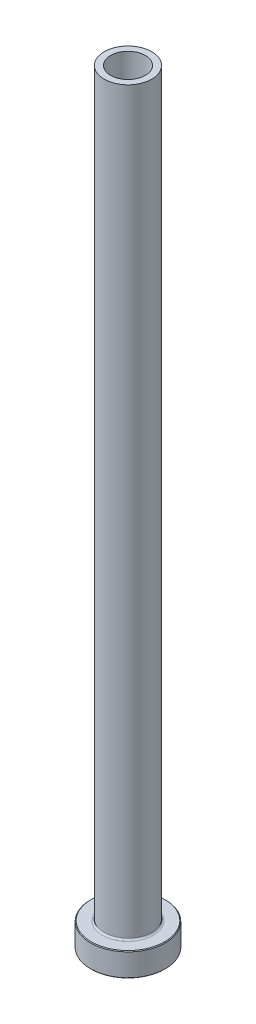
from build123d import *

# Parameters (mm, degrees)
FILLET1_R     = 0.5
CHAMFER1_SIZE = 0.2
CHAMFER3_SIZE = 0.5


with BuildPart() as part:
    # Sketch1 → Revolve1 (revolve)
    with BuildSketch(Plane.XY, mode=Mode.PRIVATE) as revolve1_sk:
        Polygon((-5.1, 225), (-7, 225), (-7, 7), (-11, 7), (-11, 0), (-5.35, 0), (-5.35, 158), (-5.1, 170), align=None)
    revolve(revolve1_sk.sketch.rotate(Axis((0, 92.187680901, 0), (0, -1, 0)), 270), axis=Axis((0, 92.187680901, 0), (0, -1, 0)))

    # Fillet1
    fillet1_edges = [part.edges().sort_by_distance(p)[0] for p in [
        (0, 7, -7),
    ]]
    fillet(fillet1_edges, radius=FILLET1_R)

    # Chamfer1
    chamfer1_edges = [part.edges().sort_by_distance(p)[0] for p in [
        (0, 0, -11),
        (0, 7, -11),
    ]]
    chamfer(chamfer1_edges, length=CHAMFER1_SIZE)

    # Chamfer3
    chamfer3_edges = [part.edges().sort_by_distance(p)[0] for p in [
        (0, 0, -5.35),
    ]]
    chamfer(chamfer3_edges, length=CHAMFER3_SIZE)


solid = part.part
